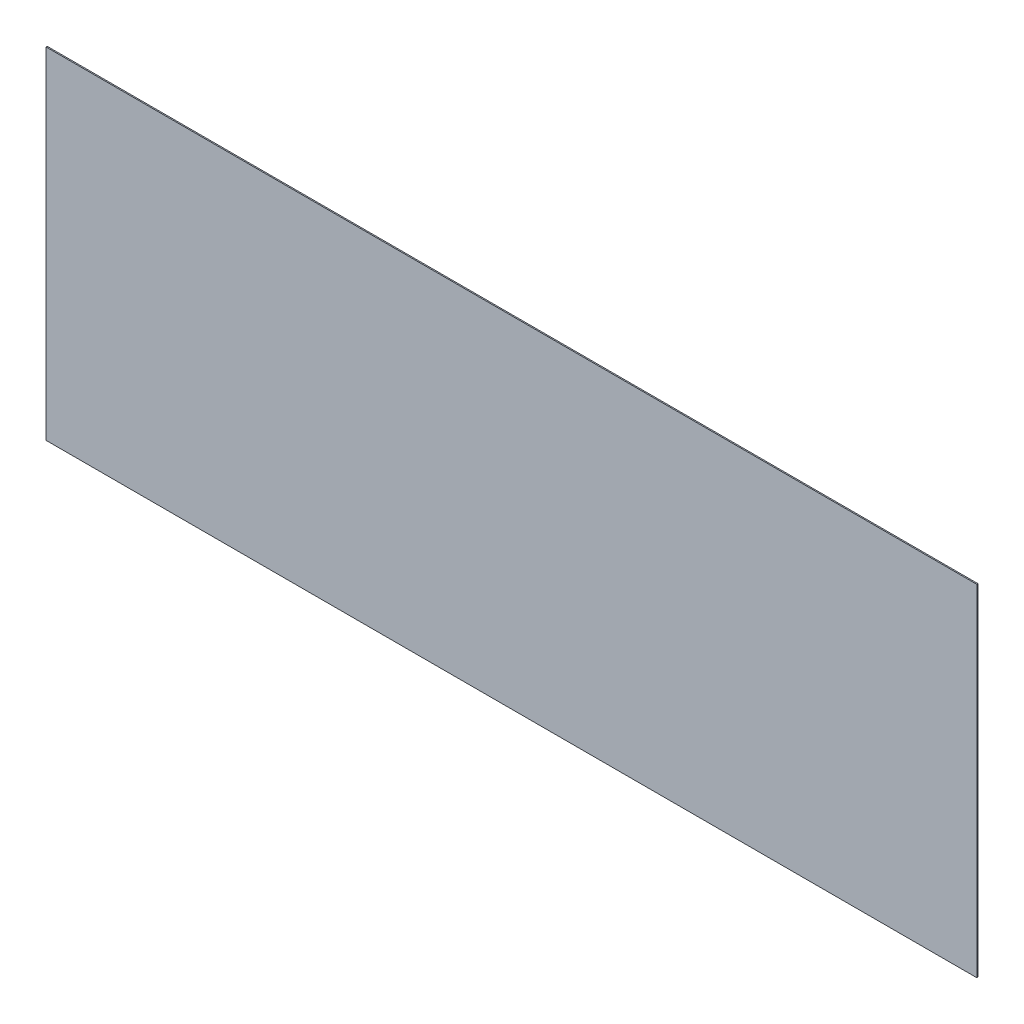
ISO-10303-21;
HEADER;
FILE_DESCRIPTION(('STEP AP214'),'2;1');
FILE_NAME('part.step','',(''),(''),'','','');
FILE_SCHEMA(('AUTOMOTIVE_DESIGN { 1 0 10303 214 1 1 1 1 }'));
ENDSEC;
DATA;
#1=APPLICATION_CONTEXT('core data for automotive mechanical design processes');
#2=APPLICATION_PROTOCOL_DEFINITION('international standard','automotive_design',2000,#1);
#3=PRODUCT_CONTEXT('',#1,'mechanical');
#4=PRODUCT('Part','Part','',(#3));
#5=PRODUCT_RELATED_PRODUCT_CATEGORY('part','',(#4));
#6=PRODUCT_DEFINITION_FORMATION('','',#4);
#7=PRODUCT_DEFINITION_CONTEXT('part definition',#1,'design');
#8=PRODUCT_DEFINITION('design','',#6,#7);
#9=PRODUCT_DEFINITION_SHAPE('','',#8);
#10=(LENGTH_UNIT() NAMED_UNIT(*) SI_UNIT(.MILLI.,.METRE.));
#11=(NAMED_UNIT(*) PLANE_ANGLE_UNIT() SI_UNIT($,.RADIAN.));
#12=(NAMED_UNIT(*) SI_UNIT($,.STERADIAN.) SOLID_ANGLE_UNIT());
#13=UNCERTAINTY_MEASURE_WITH_UNIT(LENGTH_MEASURE(1.E-05),#10,'distance_accuracy_value','');
#14=(GEOMETRIC_REPRESENTATION_CONTEXT(3) GLOBAL_UNCERTAINTY_ASSIGNED_CONTEXT((#13)) GLOBAL_UNIT_ASSIGNED_CONTEXT((#10,
#11,#12)) REPRESENTATION_CONTEXT('',''));
#15=CARTESIAN_POINT('',(0.,0.,0.));
#16=DIRECTION('',(0.,0.,1.));
#17=DIRECTION('',(1.,0.,0.));
#18=AXIS2_PLACEMENT_3D('',#15,#16,#17);
#19=CARTESIAN_POINT('',(-1325.,-485.,3.30739299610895));
#20=DIRECTION('',(1.,0.,0.));
#21=DIRECTION('',(0.,0.,-1.));
#22=AXIS2_PLACEMENT_3D('',#19,#20,#21);
#23=PLANE('',#22);
#24=DIRECTION('',(0.,-1.,0.));
#25=VECTOR('',#24,1.);
#26=CARTESIAN_POINT('',(-1325.,-485.,0.));
#27=LINE('',#26,#25);
#28=CARTESIAN_POINT('',(-1325.,485.,0.));
#29=VERTEX_POINT('',#28);
#30=CARTESIAN_POINT('',(-1325.,-485.,0.));
#31=VERTEX_POINT('',#30);
#32=EDGE_CURVE('E96',#29,#31,#27,.T.);
#33=ORIENTED_EDGE('',*,*,#32,.T.);
#34=DIRECTION('',(0.,0.,-1.));
#35=VECTOR('',#34,1.);
#36=CARTESIAN_POINT('',(-1325.,-485.,3.30739299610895));
#37=LINE('',#36,#35);
#38=CARTESIAN_POINT('',(-1325.,-485.,3.30739299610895));
#39=VERTEX_POINT('',#38);
#40=EDGE_CURVE('E11',#39,#31,#37,.T.);
#41=ORIENTED_EDGE('',*,*,#40,.F.);
#42=DIRECTION('',(0.,-1.,0.));
#43=VECTOR('',#42,1.);
#44=CARTESIAN_POINT('',(-1325.,-485.,3.30739299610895));
#45=LINE('',#44,#43);
#46=CARTESIAN_POINT('',(-1325.,485.,3.30739299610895));
#47=VERTEX_POINT('',#46);
#48=EDGE_CURVE('E84',#47,#39,#45,.T.);
#49=ORIENTED_EDGE('',*,*,#48,.F.);
#50=DIRECTION('',(0.,0.,-1.));
#51=VECTOR('',#50,1.);
#52=CARTESIAN_POINT('',(-1325.,485.,3.30739299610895));
#53=LINE('',#52,#51);
#54=EDGE_CURVE('E92',#47,#29,#53,.T.);
#55=ORIENTED_EDGE('',*,*,#54,.T.);
#56=EDGE_LOOP('',(#33,#41,#49,#55));
#57=FACE_BOUND('',#56,.T.);
#58=ADVANCED_FACE('F33',(#57),#23,.F.);
#59=CARTESIAN_POINT('',(1325.,-485.,3.30739299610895));
#60=DIRECTION('',(0.,1.,0.));
#61=DIRECTION('',(-1.,0.,0.));
#62=AXIS2_PLACEMENT_3D('',#59,#60,#61);
#63=PLANE('',#62);
#64=DIRECTION('',(1.,0.,0.));
#65=VECTOR('',#64,1.);
#66=CARTESIAN_POINT('',(1325.,-485.,0.));
#67=LINE('',#66,#65);
#68=CARTESIAN_POINT('',(1325.,-485.,0.));
#69=VERTEX_POINT('',#68);
#70=EDGE_CURVE('E88',#31,#69,#67,.T.);
#71=ORIENTED_EDGE('',*,*,#70,.T.);
#72=DIRECTION('',(0.,0.,-1.));
#73=VECTOR('',#72,1.);
#74=CARTESIAN_POINT('',(1325.,-485.,3.30739299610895));
#75=LINE('',#74,#73);
#76=CARTESIAN_POINT('',(1325.,-485.,3.30739299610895));
#77=VERTEX_POINT('',#76);
#78=EDGE_CURVE('E41',#77,#69,#75,.T.);
#79=ORIENTED_EDGE('',*,*,#78,.F.);
#80=DIRECTION('',(1.,0.,0.));
#81=VECTOR('',#80,1.);
#82=CARTESIAN_POINT('',(1325.,-485.,3.30739299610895));
#83=LINE('',#82,#81);
#84=EDGE_CURVE('E79',#39,#77,#83,.T.);
#85=ORIENTED_EDGE('',*,*,#84,.F.);
#86=ORIENTED_EDGE('',*,*,#40,.T.);
#87=EDGE_LOOP('',(#71,#79,#85,#86));
#88=FACE_BOUND('',#87,.T.);
#89=ADVANCED_FACE('F87',(#88),#63,.F.);
#90=CARTESIAN_POINT('',(1325.,-485.,3.30739299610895));
#91=DIRECTION('',(-1.,0.,0.));
#92=DIRECTION('',(0.,0.,1.));
#93=AXIS2_PLACEMENT_3D('',#90,#91,#92);
#94=PLANE('',#93);
#95=DIRECTION('',(0.,1.,0.));
#96=VECTOR('',#95,1.);
#97=CARTESIAN_POINT('',(1325.,-485.,0.));
#98=LINE('',#97,#96);
#99=CARTESIAN_POINT('',(1325.,485.,0.));
#100=VERTEX_POINT('',#99);
#101=EDGE_CURVE('E66',#69,#100,#98,.T.);
#102=ORIENTED_EDGE('',*,*,#101,.T.);
#103=DIRECTION('',(0.,0.,-1.));
#104=VECTOR('',#103,1.);
#105=CARTESIAN_POINT('',(1325.,485.,3.30739299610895));
#106=LINE('',#105,#104);
#107=CARTESIAN_POINT('',(1325.,485.,3.30739299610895));
#108=VERTEX_POINT('',#107);
#109=EDGE_CURVE('E89',#108,#100,#106,.T.);
#110=ORIENTED_EDGE('',*,*,#109,.F.);
#111=DIRECTION('',(0.,1.,0.));
#112=VECTOR('',#111,1.);
#113=CARTESIAN_POINT('',(1325.,-485.,3.30739299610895));
#114=LINE('',#113,#112);
#115=EDGE_CURVE('E82',#77,#108,#114,.T.);
#116=ORIENTED_EDGE('',*,*,#115,.F.);
#117=ORIENTED_EDGE('',*,*,#78,.T.);
#118=EDGE_LOOP('',(#102,#110,#116,#117));
#119=FACE_BOUND('',#118,.T.);
#120=ADVANCED_FACE('F90',(#119),#94,.F.);
#121=CARTESIAN_POINT('',(1325.,485.,3.30739299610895));
#122=DIRECTION('',(0.,-1.,0.));
#123=DIRECTION('',(1.,0.,0.));
#124=AXIS2_PLACEMENT_3D('',#121,#122,#123);
#125=PLANE('',#124);
#126=DIRECTION('',(-1.,0.,0.));
#127=VECTOR('',#126,1.);
#128=CARTESIAN_POINT('',(1325.,485.,0.));
#129=LINE('',#128,#127);
#130=EDGE_CURVE('E72',#100,#29,#129,.T.);
#131=ORIENTED_EDGE('',*,*,#130,.T.);
#132=ORIENTED_EDGE('',*,*,#54,.F.);
#133=DIRECTION('',(-1.,0.,0.));
#134=VECTOR('',#133,1.);
#135=CARTESIAN_POINT('',(1325.,485.,3.30739299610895));
#136=LINE('',#135,#134);
#137=EDGE_CURVE('E49',#108,#47,#136,.T.);
#138=ORIENTED_EDGE('',*,*,#137,.F.);
#139=ORIENTED_EDGE('',*,*,#109,.T.);
#140=EDGE_LOOP('',(#131,#132,#138,#139));
#141=FACE_BOUND('',#140,.T.);
#142=ADVANCED_FACE('F103',(#141),#125,.F.);
#143=CARTESIAN_POINT('',(0.,0.,3.30739299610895));
#144=DIRECTION('',(0.,0.,1.));
#145=DIRECTION('',(1.,0.,0.));
#146=AXIS2_PLACEMENT_3D('',#143,#144,#145);
#147=PLANE('',#146);
#148=ORIENTED_EDGE('',*,*,#48,.T.);
#149=ORIENTED_EDGE('',*,*,#84,.T.);
#150=ORIENTED_EDGE('',*,*,#115,.T.);
#151=ORIENTED_EDGE('',*,*,#137,.T.);
#152=EDGE_LOOP('',(#148,#149,#150,#151));
#153=FACE_BOUND('',#152,.T.);
#154=ADVANCED_FACE('F80',(#153),#147,.T.);
#155=CARTESIAN_POINT('',(0.,0.,0.));
#156=DIRECTION('',(0.,0.,1.));
#157=DIRECTION('',(1.,0.,0.));
#158=AXIS2_PLACEMENT_3D('',#155,#156,#157);
#159=PLANE('',#158);
#160=ORIENTED_EDGE('',*,*,#32,.F.);
#161=ORIENTED_EDGE('',*,*,#130,.F.);
#162=ORIENTED_EDGE('',*,*,#101,.F.);
#163=ORIENTED_EDGE('',*,*,#70,.F.);
#164=EDGE_LOOP('',(#160,#161,#162,#163));
#165=FACE_BOUND('',#164,.T.);
#166=ADVANCED_FACE('F106',(#165),#159,.F.);
#167=CLOSED_SHELL('',(#58,#89,#120,#142,#154,#166));
#168=MANIFOLD_SOLID_BREP('B2',#167);
#169=ADVANCED_BREP_SHAPE_REPRESENTATION('',(#18,#168),#14);
#170=SHAPE_DEFINITION_REPRESENTATION(#9,#169);
ENDSEC;
END-ISO-10303-21;
